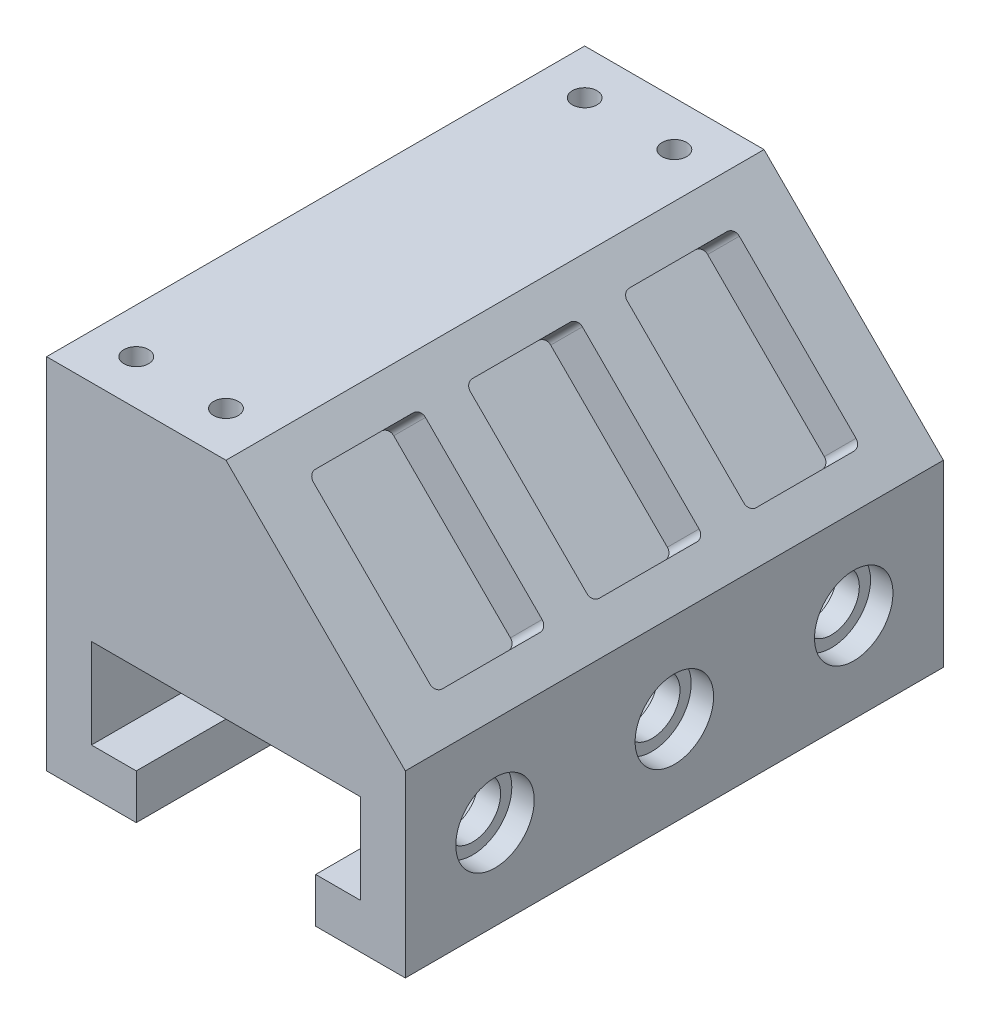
from build123d import *

# Parameters (mm, degrees)
BOSS_EXTRUDE1_DEPTH                                  = 152.4
CUT_EXTRUDE1_DEPTH                                   = 12.7
CBORE_FOR_1_4_BINDING_HEAD_MACHINE_SCREW_D           = 15.875
CBORE_FOR_1_4_BINDING_HEAD_MACHINE_SCREW_CBORE_D     = 22.225
CBORE_FOR_1_4_BINDING_HEAD_MACHINE_SCREW_CBORE_DEPTH = 6.35
LPATTERN1_COUNT                                      = 3
LPATTERN1_PITCH                                      = 50.8
MIRROR1_COPY_1_D                                     = 15.875
MIRROR1_COPY_1_CBORE_D                               = 22.225
MIRROR1_COPY_1_CBORE_DEPTH                           = 6.35
MIRROR1_COPY_2_D                                     = 15.875
MIRROR1_COPY_2_CBORE_D                               = 22.225
MIRROR1_COPY_2_CBORE_DEPTH                           = 6.35
SKETCH6_R                                            = 3.4925
CUT_EXTRUDE2_DEPTH                                   = 25.4


with BuildPart() as part:
    # Sketch1 (on Front Plane) → Boss-Extrude1 (new body)
    with BuildSketch(Plane.XY):
        Polygon((0, 0), (0, 101.6), (50.8, 101.6), (101.6, 50.8), (101.6, 0), (76.2, 0), (76.2, 12.7), (88.9, 12.7), (88.9, 38.1), (12.7, 38.1), (12.7, 12.7), (25.4, 12.7), (25.4, 0), align=None)
    extrude(amount=-BOSS_EXTRUDE1_DEPTH)

    # Sketch2 → Cut-Extrude1 (cut)
    with BuildSketch(Plane(origin=(76.2, 76.2, 0), x_dir=(0, 0, -1), z_dir=(0.7071067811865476, 0.7071067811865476, 0))):
        with BuildLine():
            Line((60.325, -23.368), (60.325, 23.368))
            ThreePointArc((60.325, 23.368), (60.920159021, 24.804840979), (62.357, 25.4))
            Line((62.357, 25.4), (90.043, 25.4))
            ThreePointArc((90.043, 25.4), (91.479840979, 24.804840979), (92.075, 23.368))
            Line((92.075, 23.368), (92.075, -23.368))
            ThreePointArc((92.075, -23.368), (91.479840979, -24.804840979), (90.043, -25.4))
            Line((90.043, -25.4), (62.357, -25.4))
            ThreePointArc((62.357, -25.4), (60.920159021, -24.804840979), (60.325, -23.368))
        make_face()
        with BuildLine():
            Line((17.907, -25.4), (45.593, -25.4))
            ThreePointArc((45.593, -25.4), (47.029840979, -24.804840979), (47.625, -23.368))
            Line((47.625, -23.368), (47.625, 23.368))
            ThreePointArc((47.625, 23.368), (47.029840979, 24.804840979), (45.593, 25.4))
            Line((45.593, 25.4), (17.907, 25.4))
            ThreePointArc((17.907, 25.4), (16.470159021, 24.804840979), (15.875, 23.368))
            Line((15.875, 23.368), (15.875, -23.368))
            ThreePointArc((15.875, -23.368), (16.470159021, -24.804840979), (17.907, -25.4))
        make_face()
        with BuildLine():
            Line((104.775, -23.368), (104.775, 23.368))
            ThreePointArc((104.775, 23.368), (105.370159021, 24.804840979), (106.807, 25.4))
            Line((106.807, 25.4), (134.493, 25.4))
            ThreePointArc((134.493, 25.4), (135.929840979, 24.804840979), (136.525, 23.368))
            Line((136.525, 23.368), (136.525, -23.368))
            ThreePointArc((136.525, -23.368), (135.929840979, -24.804840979), (134.493, -25.4))
            Line((134.493, -25.4), (106.807, -25.4))
            ThreePointArc((106.807, -25.4), (105.370159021, -24.804840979), (104.775, -23.368))
        make_face()
    extrude(amount=-CUT_EXTRUDE1_DEPTH, mode=Mode.SUBTRACT)

    # CBORE for 1_4 Binding Head Machine Screw (through all)
    with Locations(Plane(origin=(101.6, 0, 0), x_dir=(0, 0, -1), z_dir=(1, 0, 0))):
        with Locations((25.4, 25.4)):
            cbore_for_1_4_binding_head_machine_screw = CounterBoreHole(CBORE_FOR_1_4_BINDING_HEAD_MACHINE_SCREW_D / 2, CBORE_FOR_1_4_BINDING_HEAD_MACHINE_SCREW_CBORE_D / 2, CBORE_FOR_1_4_BINDING_HEAD_MACHINE_SCREW_CBORE_DEPTH)

    # LPattern1: CBORE for 1_4 Binding Head Machine Screw ×3
    with Locations(*[(0, 0, -i * LPATTERN1_PITCH) for i in range(1, LPATTERN1_COUNT)]):
        add(cbore_for_1_4_binding_head_machine_screw, mode=Mode.SUBTRACT)

    # Mirror1: CBORE for 1_4 Binding Head Machine Screw across plane
    add(cbore_for_1_4_binding_head_machine_screw.mirror(Plane(origin=(50.8, 0, 0), x_dir=(0, 0, 1), z_dir=(1, 0, 0))), mode=Mode.SUBTRACT)

    # Mirror1 copy 1 (through all)
    with Locations(Plane(origin=(0, 0, -50.8), x_dir=(0, 0, -1), z_dir=(-1, 0, 0))):
        with Locations((25.4, -25.4)):
            CounterBoreHole(MIRROR1_COPY_1_D / 2, MIRROR1_COPY_1_CBORE_D / 2, MIRROR1_COPY_1_CBORE_DEPTH)

    # Mirror1 copy 2 (through all)
    with Locations(Plane(origin=(0, 0, -101.6), x_dir=(0, 0, -1), z_dir=(-1, 0, 0))):
        with Locations((25.4, -25.4)):
            CounterBoreHole(MIRROR1_COPY_2_D / 2, MIRROR1_COPY_2_CBORE_D / 2, MIRROR1_COPY_2_CBORE_DEPTH)

    # Sketch6 → Cut-Extrude2 (cut)
    with BuildSketch(Plane(origin=(0, 101.6, 0), x_dir=(1, 0, 0), z_dir=(0, 1, 0))):
        with Locations(Location((12.7, 12.7, 0), (0, 0, 270))):
            Circle(SKETCH6_R)
        with Locations(Location((38.1, 12.7, 0), (0, 0, 270))):
            Circle(SKETCH6_R)
        with Locations(Location((38.1, 139.7, 0), (0, 0, 270))):
            Circle(SKETCH6_R)
        with Locations(Location((12.7, 139.7, 0), (0, 0, 270))):
            Circle(SKETCH6_R)
    extrude(amount=-CUT_EXTRUDE2_DEPTH, mode=Mode.SUBTRACT)


solid = part.part
